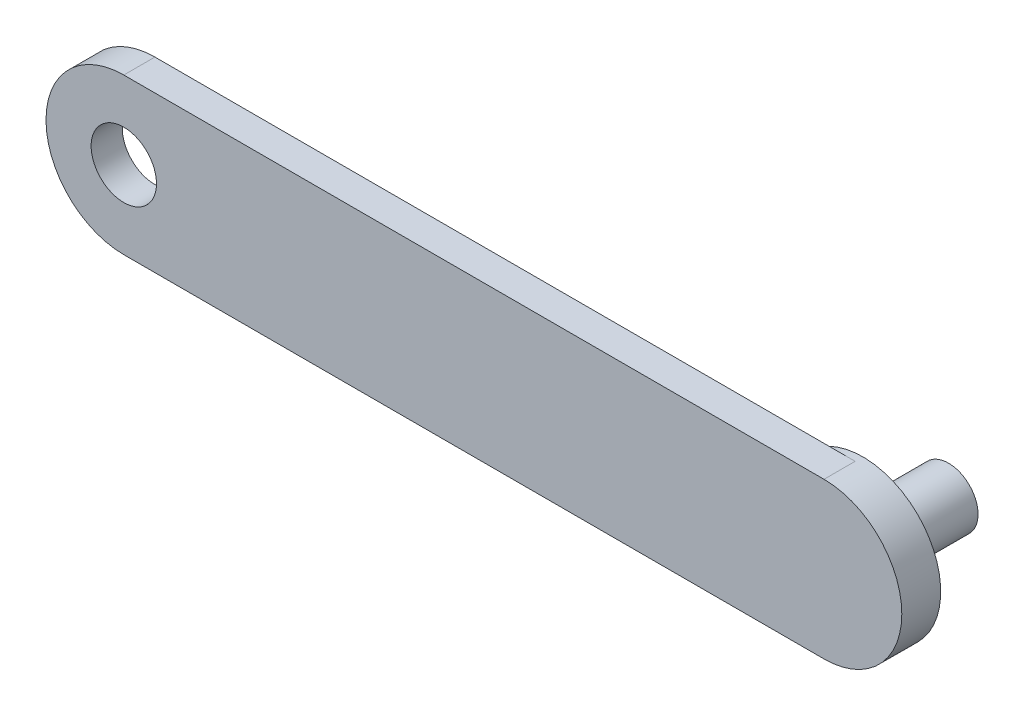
from build123d import *

# Parameters (mm, degrees)
ESQUISSE1_R        = 2.1
BOSS_EXTRU_1_DEPTH = 2
ESQUISSE2_R        = 1.9
BOSS_EXTRU_2_DEPTH = 6
ESQUISSE3_R        = 5
ESQUISSE3_R_2      = 1.9
BOSS_EXTRU_3_DEPTH = 0.5


with BuildPart() as part:
    # Esquisse1 → Boss.-Extru.1 (new body)
    with BuildSketch(Plane.XY):
        with BuildLine():
            Line((0, 5), (45, 5))
            ThreePointArc((45, 5), (50, 0), (45, -5))
            Line((45, -5), (0, -5))
            ThreePointArc((0, -5), (-5, 0), (0, 5))
        make_face()
        Circle(ESQUISSE1_R, mode=Mode.SUBTRACT)
    extrude(amount=BOSS_EXTRU_1_DEPTH)

    # Esquisse2 → Boss.-Extru.2 (add)
    with BuildSketch(Plane(origin=(0, 0, 0), x_dir=(-1, 0, 0), z_dir=(0, 0, -1))):
        with Locations(Location((-45, 0, 0), (0, 0, 180))):
            Circle(ESQUISSE2_R)
    extrude(amount=BOSS_EXTRU_2_DEPTH)

    # Esquisse3 → Boss.-Extru.3 (add)
    with BuildSketch(Plane(origin=(0, 0, 0), x_dir=(-1, 0, 0), z_dir=(0, 0, -1))):
        with Locations((-45, 0)):
            Circle(ESQUISSE3_R)
        with Locations((-45, 0)):
            Circle(ESQUISSE3_R_2, mode=Mode.SUBTRACT)
    extrude(amount=BOSS_EXTRU_3_DEPTH)


solid = part.part
